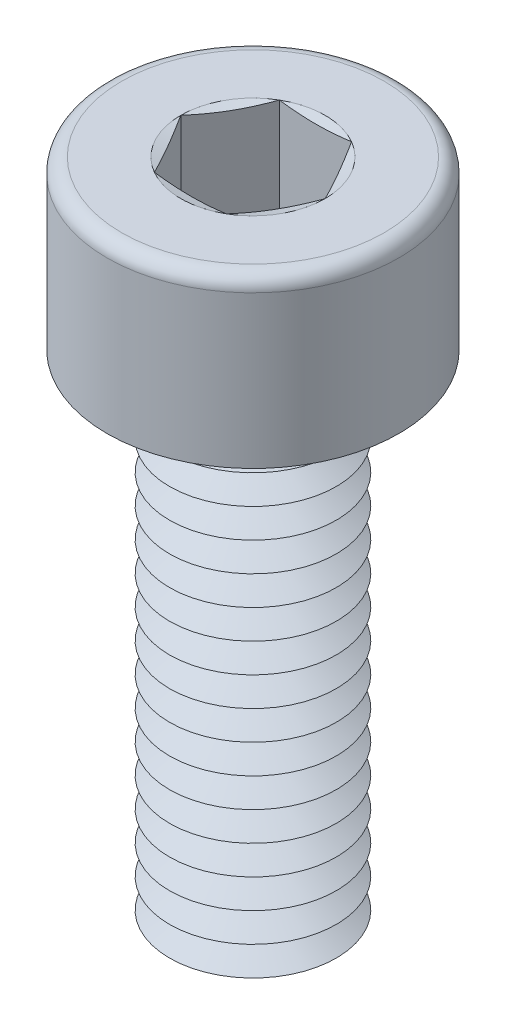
ISO-10303-21;
HEADER;
FILE_DESCRIPTION(('STEP AP214'),'2;1');
FILE_NAME('part.step','',(''),(''),'','','');
FILE_SCHEMA(('AUTOMOTIVE_DESIGN { 1 0 10303 214 1 1 1 1 }'));
ENDSEC;
DATA;
#1=APPLICATION_CONTEXT('core data for automotive mechanical design processes');
#2=APPLICATION_PROTOCOL_DEFINITION('international standard','automotive_design',2000,#1);
#3=PRODUCT_CONTEXT('',#1,'mechanical');
#4=PRODUCT('Part','Part','',(#3));
#5=PRODUCT_RELATED_PRODUCT_CATEGORY('part','',(#4));
#6=PRODUCT_DEFINITION_FORMATION('','',#4);
#7=PRODUCT_DEFINITION_CONTEXT('part definition',#1,'design');
#8=PRODUCT_DEFINITION('design','',#6,#7);
#9=PRODUCT_DEFINITION_SHAPE('','',#8);
#10=(LENGTH_UNIT() NAMED_UNIT(*) SI_UNIT(.MILLI.,.METRE.));
#11=(NAMED_UNIT(*) PLANE_ANGLE_UNIT() SI_UNIT($,.RADIAN.));
#12=(NAMED_UNIT(*) SI_UNIT($,.STERADIAN.) SOLID_ANGLE_UNIT());
#13=UNCERTAINTY_MEASURE_WITH_UNIT(LENGTH_MEASURE(1.E-05),#10,'distance_accuracy_value','');
#14=(GEOMETRIC_REPRESENTATION_CONTEXT(3) GLOBAL_UNCERTAINTY_ASSIGNED_CONTEXT((#13)) GLOBAL_UNIT_ASSIGNED_CONTEXT((#10,
#11,#12)) REPRESENTATION_CONTEXT('',''));
#15=CARTESIAN_POINT('',(0.,0.,0.));
#16=DIRECTION('',(0.,0.,1.));
#17=DIRECTION('',(1.,0.,0.));
#18=AXIS2_PLACEMENT_3D('',#15,#16,#17);
#19=CARTESIAN_POINT('',(0.,2.8,0.));
#20=DIRECTION('',(0.,1.,0.));
#21=DIRECTION('',(0.,0.,1.));
#22=AXIS2_PLACEMENT_3D('',#19,#20,#21);
#23=CONICAL_SURFACE('',#22,1.39378221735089,1.0471975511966);
#24=CARTESIAN_POINT('',(0.,3.15,0.));
#25=DIRECTION('',(0.,1.,0.));
#26=DIRECTION('',(0.,0.,1.));
#27=AXIS2_PLACEMENT_3D('',#24,#25,#26);
#28=CIRCLE('',#27,2.);
#29=CARTESIAN_POINT('',(0.,3.15,2.));
#30=VERTEX_POINT('',#29);
#31=EDGE_CURVE('E447',#30,#30,#28,.T.);
#32=ORIENTED_EDGE('',*,*,#31,.F.);
#33=EDGE_LOOP('',(#32));
#34=FACE_BOUND('',#33,.T.);
#35=CARTESIAN_POINT('',(0.,2.8,0.));
#36=DIRECTION('',(0.,1.,0.));
#37=DIRECTION('',(0.,0.,1.));
#38=AXIS2_PLACEMENT_3D('',#35,#36,#37);
#39=CIRCLE('',#38,1.39378221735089);
#40=CARTESIAN_POINT('',(0.,2.8,1.39378221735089));
#41=VERTEX_POINT('',#40);
#42=EDGE_CURVE('E451',#41,#41,#39,.T.);
#43=ORIENTED_EDGE('',*,*,#42,.T.);
#44=EDGE_LOOP('',(#43));
#45=FACE_BOUND('',#44,.T.);
#46=ADVANCED_FACE('F41',(#34,#45),#23,.T.);
#47=CARTESIAN_POINT('',(0.,2.45,0.));
#48=DIRECTION('',(0.,-1.,0.));
#49=DIRECTION('',(0.,0.,-1.));
#50=AXIS2_PLACEMENT_3D('',#47,#48,#49);
#51=CONICAL_SURFACE('',#50,2.,1.0471975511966);
#52=ORIENTED_EDGE('',*,*,#42,.F.);
#53=EDGE_LOOP('',(#52));
#54=FACE_BOUND('',#53,.T.);
#55=CARTESIAN_POINT('',(0.,2.45,0.));
#56=DIRECTION('',(0.,1.,0.));
#57=DIRECTION('',(0.,0.,1.));
#58=AXIS2_PLACEMENT_3D('',#55,#56,#57);
#59=CIRCLE('',#58,2.);
#60=CARTESIAN_POINT('',(0.,2.45,2.));
#61=VERTEX_POINT('',#60);
#62=EDGE_CURVE('E455',#61,#61,#59,.T.);
#63=ORIENTED_EDGE('',*,*,#62,.T.);
#64=EDGE_LOOP('',(#63));
#65=FACE_BOUND('',#64,.T.);
#66=ADVANCED_FACE('F251',(#54,#65),#51,.T.);
#67=CARTESIAN_POINT('',(0.,0.,0.));
#68=DIRECTION('',(0.,1.,0.));
#69=DIRECTION('',(0.,0.,1.));
#70=AXIS2_PLACEMENT_3D('',#67,#68,#69);
#71=PLANE('',#70);
#72=CARTESIAN_POINT('',(0.,0.,0.));
#73=DIRECTION('',(0.,1.,0.));
#74=DIRECTION('',(0.,0.,1.));
#75=AXIS2_PLACEMENT_3D('',#72,#73,#74);
#76=CIRCLE('',#75,1.39378221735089);
#77=CARTESIAN_POINT('',(0.,0.,1.39378221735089));
#78=VERTEX_POINT('',#77);
#79=EDGE_CURVE('E483',#78,#78,#76,.T.);
#80=ORIENTED_EDGE('',*,*,#79,.F.);
#81=EDGE_LOOP('',(#80));
#82=FACE_BOUND('',#81,.T.);
#83=ADVANCED_FACE('F248',(#82),#71,.F.);
#84=CARTESIAN_POINT('',(0.,0.,0.));
#85=DIRECTION('',(0.,1.,0.));
#86=DIRECTION('',(0.,0.,1.));
#87=AXIS2_PLACEMENT_3D('',#84,#85,#86);
#88=CONICAL_SURFACE('',#87,1.39378221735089,1.0471975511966);
#89=CARTESIAN_POINT('',(0.,0.35,0.));
#90=DIRECTION('',(0.,1.,0.));
#91=DIRECTION('',(0.,0.,1.));
#92=AXIS2_PLACEMENT_3D('',#89,#90,#91);
#93=CIRCLE('',#92,2.);
#94=CARTESIAN_POINT('',(0.,0.35,2.));
#95=VERTEX_POINT('',#94);
#96=EDGE_CURVE('E479',#95,#95,#93,.T.);
#97=ORIENTED_EDGE('',*,*,#96,.F.);
#98=EDGE_LOOP('',(#97));
#99=FACE_BOUND('',#98,.T.);
#100=ORIENTED_EDGE('',*,*,#79,.T.);
#101=EDGE_LOOP('',(#100));
#102=FACE_BOUND('',#101,.T.);
#103=ADVANCED_FACE('F250',(#99,#102),#88,.T.);
#104=CARTESIAN_POINT('',(0.,0.35,0.));
#105=DIRECTION('',(0.,-1.,0.));
#106=DIRECTION('',(0.,0.,-1.));
#107=AXIS2_PLACEMENT_3D('',#104,#105,#106);
#108=CONICAL_SURFACE('',#107,2.,1.0471975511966);
#109=CARTESIAN_POINT('',(0.,0.7,0.));
#110=DIRECTION('',(0.,1.,0.));
#111=DIRECTION('',(0.,0.,1.));
#112=AXIS2_PLACEMENT_3D('',#109,#110,#111);
#113=CIRCLE('',#112,1.39378221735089);
#114=CARTESIAN_POINT('',(0.,0.7,1.39378221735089));
#115=VERTEX_POINT('',#114);
#116=EDGE_CURVE('E475',#115,#115,#113,.T.);
#117=ORIENTED_EDGE('',*,*,#116,.F.);
#118=EDGE_LOOP('',(#117));
#119=FACE_BOUND('',#118,.T.);
#120=ORIENTED_EDGE('',*,*,#96,.T.);
#121=EDGE_LOOP('',(#120));
#122=FACE_BOUND('',#121,.T.);
#123=ADVANCED_FACE('F291',(#119,#122),#108,.T.);
#124=CARTESIAN_POINT('',(0.,0.7,0.));
#125=DIRECTION('',(0.,1.,0.));
#126=DIRECTION('',(0.,0.,1.));
#127=AXIS2_PLACEMENT_3D('',#124,#125,#126);
#128=CONICAL_SURFACE('',#127,1.39378221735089,1.0471975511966);
#129=CARTESIAN_POINT('',(0.,1.05,0.));
#130=DIRECTION('',(0.,1.,0.));
#131=DIRECTION('',(0.,0.,1.));
#132=AXIS2_PLACEMENT_3D('',#129,#130,#131);
#133=CIRCLE('',#132,2.);
#134=CARTESIAN_POINT('',(0.,1.05,2.));
#135=VERTEX_POINT('',#134);
#136=EDGE_CURVE('E471',#135,#135,#133,.T.);
#137=ORIENTED_EDGE('',*,*,#136,.F.);
#138=EDGE_LOOP('',(#137));
#139=FACE_BOUND('',#138,.T.);
#140=ORIENTED_EDGE('',*,*,#116,.T.);
#141=EDGE_LOOP('',(#140));
#142=FACE_BOUND('',#141,.T.);
#143=ADVANCED_FACE('F286',(#139,#142),#128,.T.);
#144=CARTESIAN_POINT('',(0.,1.05,0.));
#145=DIRECTION('',(0.,-1.,0.));
#146=DIRECTION('',(0.,0.,-1.));
#147=AXIS2_PLACEMENT_3D('',#144,#145,#146);
#148=CONICAL_SURFACE('',#147,2.,1.0471975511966);
#149=CARTESIAN_POINT('',(0.,1.4,0.));
#150=DIRECTION('',(0.,1.,0.));
#151=DIRECTION('',(0.,0.,1.));
#152=AXIS2_PLACEMENT_3D('',#149,#150,#151);
#153=CIRCLE('',#152,1.39378221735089);
#154=CARTESIAN_POINT('',(0.,1.4,1.39378221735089));
#155=VERTEX_POINT('',#154);
#156=EDGE_CURVE('E467',#155,#155,#153,.T.);
#157=ORIENTED_EDGE('',*,*,#156,.F.);
#158=EDGE_LOOP('',(#157));
#159=FACE_BOUND('',#158,.T.);
#160=ORIENTED_EDGE('',*,*,#136,.T.);
#161=EDGE_LOOP('',(#160));
#162=FACE_BOUND('',#161,.T.);
#163=ADVANCED_FACE('F283',(#159,#162),#148,.T.);
#164=CARTESIAN_POINT('',(0.,1.4,0.));
#165=DIRECTION('',(0.,1.,0.));
#166=DIRECTION('',(0.,0.,1.));
#167=AXIS2_PLACEMENT_3D('',#164,#165,#166);
#168=CONICAL_SURFACE('',#167,1.39378221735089,1.0471975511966);
#169=CARTESIAN_POINT('',(0.,1.75,0.));
#170=DIRECTION('',(0.,1.,0.));
#171=DIRECTION('',(0.,0.,1.));
#172=AXIS2_PLACEMENT_3D('',#169,#170,#171);
#173=CIRCLE('',#172,2.);
#174=CARTESIAN_POINT('',(0.,1.75,2.));
#175=VERTEX_POINT('',#174);
#176=EDGE_CURVE('E463',#175,#175,#173,.T.);
#177=ORIENTED_EDGE('',*,*,#176,.F.);
#178=EDGE_LOOP('',(#177));
#179=FACE_BOUND('',#178,.T.);
#180=ORIENTED_EDGE('',*,*,#156,.T.);
#181=EDGE_LOOP('',(#180));
#182=FACE_BOUND('',#181,.T.);
#183=ADVANCED_FACE('F277',(#179,#182),#168,.T.);
#184=CARTESIAN_POINT('',(0.,1.75,0.));
#185=DIRECTION('',(0.,-1.,0.));
#186=DIRECTION('',(0.,0.,-1.));
#187=AXIS2_PLACEMENT_3D('',#184,#185,#186);
#188=CONICAL_SURFACE('',#187,2.,1.0471975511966);
#189=CARTESIAN_POINT('',(0.,2.1,0.));
#190=DIRECTION('',(0.,1.,0.));
#191=DIRECTION('',(0.,0.,1.));
#192=AXIS2_PLACEMENT_3D('',#189,#190,#191);
#193=CIRCLE('',#192,1.39378221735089);
#194=CARTESIAN_POINT('',(0.,2.1,1.39378221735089));
#195=VERTEX_POINT('',#194);
#196=EDGE_CURVE('E459',#195,#195,#193,.T.);
#197=ORIENTED_EDGE('',*,*,#196,.F.);
#198=EDGE_LOOP('',(#197));
#199=FACE_BOUND('',#198,.T.);
#200=ORIENTED_EDGE('',*,*,#176,.T.);
#201=EDGE_LOOP('',(#200));
#202=FACE_BOUND('',#201,.T.);
#203=ADVANCED_FACE('F273',(#199,#202),#188,.T.);
#204=CARTESIAN_POINT('',(0.,2.1,0.));
#205=DIRECTION('',(0.,1.,0.));
#206=DIRECTION('',(0.,0.,1.));
#207=AXIS2_PLACEMENT_3D('',#204,#205,#206);
#208=CONICAL_SURFACE('',#207,1.39378221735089,1.0471975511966);
#209=ORIENTED_EDGE('',*,*,#62,.F.);
#210=EDGE_LOOP('',(#209));
#211=FACE_BOUND('',#210,.T.);
#212=ORIENTED_EDGE('',*,*,#196,.T.);
#213=EDGE_LOOP('',(#212));
#214=FACE_BOUND('',#213,.T.);
#215=ADVANCED_FACE('F276',(#211,#214),#208,.T.);
#216=CARTESIAN_POINT('',(0.,3.5,0.));
#217=DIRECTION('',(0.,1.,0.));
#218=DIRECTION('',(0.,0.,1.));
#219=AXIS2_PLACEMENT_3D('',#216,#217,#218);
#220=CONICAL_SURFACE('',#219,1.39378221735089,1.0471975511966);
#221=CARTESIAN_POINT('',(0.,3.85,0.));
#222=DIRECTION('',(0.,1.,0.));
#223=DIRECTION('',(0.,0.,1.));
#224=AXIS2_PLACEMENT_3D('',#221,#222,#223);
#225=CIRCLE('',#224,2.);
#226=CARTESIAN_POINT('',(0.,3.85,2.));
#227=VERTEX_POINT('',#226);
#228=EDGE_CURVE('E439',#227,#227,#225,.T.);
#229=ORIENTED_EDGE('',*,*,#228,.F.);
#230=EDGE_LOOP('',(#229));
#231=FACE_BOUND('',#230,.T.);
#232=CARTESIAN_POINT('',(0.,3.5,0.));
#233=DIRECTION('',(0.,1.,0.));
#234=DIRECTION('',(0.,0.,1.));
#235=AXIS2_PLACEMENT_3D('',#232,#233,#234);
#236=CIRCLE('',#235,1.39378221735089);
#237=CARTESIAN_POINT('',(0.,3.5,1.39378221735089));
#238=VERTEX_POINT('',#237);
#239=EDGE_CURVE('E443',#238,#238,#236,.T.);
#240=ORIENTED_EDGE('',*,*,#239,.T.);
#241=EDGE_LOOP('',(#240));
#242=FACE_BOUND('',#241,.T.);
#243=ADVANCED_FACE('F281',(#231,#242),#220,.T.);
#244=CARTESIAN_POINT('',(0.,3.15,0.));
#245=DIRECTION('',(0.,-1.,0.));
#246=DIRECTION('',(0.,0.,-1.));
#247=AXIS2_PLACEMENT_3D('',#244,#245,#246);
#248=CONICAL_SURFACE('',#247,2.,1.0471975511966);
#249=ORIENTED_EDGE('',*,*,#239,.F.);
#250=EDGE_LOOP('',(#249));
#251=FACE_BOUND('',#250,.T.);
#252=ORIENTED_EDGE('',*,*,#31,.T.);
#253=EDGE_LOOP('',(#252));
#254=FACE_BOUND('',#253,.T.);
#255=ADVANCED_FACE('F724',(#251,#254),#248,.T.);
#256=CARTESIAN_POINT('',(0.,4.2,0.));
#257=DIRECTION('',(0.,1.,0.));
#258=DIRECTION('',(0.,0.,1.));
#259=AXIS2_PLACEMENT_3D('',#256,#257,#258);
#260=CONICAL_SURFACE('',#259,1.39378221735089,1.0471975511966);
#261=CARTESIAN_POINT('',(0.,4.55,0.));
#262=DIRECTION('',(0.,1.,0.));
#263=DIRECTION('',(0.,0.,1.));
#264=AXIS2_PLACEMENT_3D('',#261,#262,#263);
#265=CIRCLE('',#264,2.);
#266=CARTESIAN_POINT('',(0.,4.55,2.));
#267=VERTEX_POINT('',#266);
#268=EDGE_CURVE('E431',#267,#267,#265,.T.);
#269=ORIENTED_EDGE('',*,*,#268,.F.);
#270=EDGE_LOOP('',(#269));
#271=FACE_BOUND('',#270,.T.);
#272=CARTESIAN_POINT('',(0.,4.2,0.));
#273=DIRECTION('',(0.,1.,0.));
#274=DIRECTION('',(0.,0.,1.));
#275=AXIS2_PLACEMENT_3D('',#272,#273,#274);
#276=CIRCLE('',#275,1.39378221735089);
#277=CARTESIAN_POINT('',(0.,4.2,1.39378221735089));
#278=VERTEX_POINT('',#277);
#279=EDGE_CURVE('E435',#278,#278,#276,.T.);
#280=ORIENTED_EDGE('',*,*,#279,.T.);
#281=EDGE_LOOP('',(#280));
#282=FACE_BOUND('',#281,.T.);
#283=ADVANCED_FACE('F733',(#271,#282),#260,.T.);
#284=CARTESIAN_POINT('',(0.,3.85,0.));
#285=DIRECTION('',(0.,-1.,0.));
#286=DIRECTION('',(0.,0.,-1.));
#287=AXIS2_PLACEMENT_3D('',#284,#285,#286);
#288=CONICAL_SURFACE('',#287,2.,1.0471975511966);
#289=ORIENTED_EDGE('',*,*,#279,.F.);
#290=EDGE_LOOP('',(#289));
#291=FACE_BOUND('',#290,.T.);
#292=ORIENTED_EDGE('',*,*,#228,.T.);
#293=EDGE_LOOP('',(#292));
#294=FACE_BOUND('',#293,.T.);
#295=ADVANCED_FACE('F743',(#291,#294),#288,.T.);
#296=CARTESIAN_POINT('',(0.,4.9,0.));
#297=DIRECTION('',(0.,1.,0.));
#298=DIRECTION('',(0.,0.,1.));
#299=AXIS2_PLACEMENT_3D('',#296,#297,#298);
#300=CONICAL_SURFACE('',#299,1.39378221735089,1.0471975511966);
#301=CARTESIAN_POINT('',(0.,5.25,0.));
#302=DIRECTION('',(0.,1.,0.));
#303=DIRECTION('',(0.,0.,1.));
#304=AXIS2_PLACEMENT_3D('',#301,#302,#303);
#305=CIRCLE('',#304,2.);
#306=CARTESIAN_POINT('',(0.,5.25,2.));
#307=VERTEX_POINT('',#306);
#308=EDGE_CURVE('E423',#307,#307,#305,.T.);
#309=ORIENTED_EDGE('',*,*,#308,.F.);
#310=EDGE_LOOP('',(#309));
#311=FACE_BOUND('',#310,.T.);
#312=CARTESIAN_POINT('',(0.,4.9,0.));
#313=DIRECTION('',(0.,1.,0.));
#314=DIRECTION('',(0.,0.,1.));
#315=AXIS2_PLACEMENT_3D('',#312,#313,#314);
#316=CIRCLE('',#315,1.39378221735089);
#317=CARTESIAN_POINT('',(0.,4.9,1.39378221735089));
#318=VERTEX_POINT('',#317);
#319=EDGE_CURVE('E427',#318,#318,#316,.T.);
#320=ORIENTED_EDGE('',*,*,#319,.T.);
#321=EDGE_LOOP('',(#320));
#322=FACE_BOUND('',#321,.T.);
#323=ADVANCED_FACE('F753',(#311,#322),#300,.T.);
#324=CARTESIAN_POINT('',(0.,4.55,0.));
#325=DIRECTION('',(0.,-1.,0.));
#326=DIRECTION('',(0.,0.,-1.));
#327=AXIS2_PLACEMENT_3D('',#324,#325,#326);
#328=CONICAL_SURFACE('',#327,2.,1.0471975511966);
#329=ORIENTED_EDGE('',*,*,#319,.F.);
#330=EDGE_LOOP('',(#329));
#331=FACE_BOUND('',#330,.T.);
#332=ORIENTED_EDGE('',*,*,#268,.T.);
#333=EDGE_LOOP('',(#332));
#334=FACE_BOUND('',#333,.T.);
#335=ADVANCED_FACE('F763',(#331,#334),#328,.T.);
#336=CARTESIAN_POINT('',(0.,5.6,0.));
#337=DIRECTION('',(0.,1.,0.));
#338=DIRECTION('',(0.,0.,1.));
#339=AXIS2_PLACEMENT_3D('',#336,#337,#338);
#340=CONICAL_SURFACE('',#339,1.39378221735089,1.0471975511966);
#341=CARTESIAN_POINT('',(0.,5.95,0.));
#342=DIRECTION('',(0.,1.,0.));
#343=DIRECTION('',(0.,0.,1.));
#344=AXIS2_PLACEMENT_3D('',#341,#342,#343);
#345=CIRCLE('',#344,2.);
#346=CARTESIAN_POINT('',(0.,5.95,2.));
#347=VERTEX_POINT('',#346);
#348=EDGE_CURVE('E415',#347,#347,#345,.T.);
#349=ORIENTED_EDGE('',*,*,#348,.F.);
#350=EDGE_LOOP('',(#349));
#351=FACE_BOUND('',#350,.T.);
#352=CARTESIAN_POINT('',(0.,5.6,0.));
#353=DIRECTION('',(0.,1.,0.));
#354=DIRECTION('',(0.,0.,1.));
#355=AXIS2_PLACEMENT_3D('',#352,#353,#354);
#356=CIRCLE('',#355,1.39378221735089);
#357=CARTESIAN_POINT('',(0.,5.6,1.39378221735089));
#358=VERTEX_POINT('',#357);
#359=EDGE_CURVE('E419',#358,#358,#356,.T.);
#360=ORIENTED_EDGE('',*,*,#359,.T.);
#361=EDGE_LOOP('',(#360));
#362=FACE_BOUND('',#361,.T.);
#363=ADVANCED_FACE('F773',(#351,#362),#340,.T.);
#364=CARTESIAN_POINT('',(0.,5.25,0.));
#365=DIRECTION('',(0.,-1.,0.));
#366=DIRECTION('',(0.,0.,-1.));
#367=AXIS2_PLACEMENT_3D('',#364,#365,#366);
#368=CONICAL_SURFACE('',#367,2.,1.0471975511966);
#369=ORIENTED_EDGE('',*,*,#359,.F.);
#370=EDGE_LOOP('',(#369));
#371=FACE_BOUND('',#370,.T.);
#372=ORIENTED_EDGE('',*,*,#308,.T.);
#373=EDGE_LOOP('',(#372));
#374=FACE_BOUND('',#373,.T.);
#375=ADVANCED_FACE('F783',(#371,#374),#368,.T.);
#376=CARTESIAN_POINT('',(0.,6.3,0.));
#377=DIRECTION('',(0.,1.,0.));
#378=DIRECTION('',(0.,0.,1.));
#379=AXIS2_PLACEMENT_3D('',#376,#377,#378);
#380=CONICAL_SURFACE('',#379,1.39378221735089,1.0471975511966);
#381=CARTESIAN_POINT('',(0.,6.65,0.));
#382=DIRECTION('',(0.,1.,0.));
#383=DIRECTION('',(0.,0.,1.));
#384=AXIS2_PLACEMENT_3D('',#381,#382,#383);
#385=CIRCLE('',#384,2.);
#386=CARTESIAN_POINT('',(0.,6.65,2.));
#387=VERTEX_POINT('',#386);
#388=EDGE_CURVE('E407',#387,#387,#385,.T.);
#389=ORIENTED_EDGE('',*,*,#388,.F.);
#390=EDGE_LOOP('',(#389));
#391=FACE_BOUND('',#390,.T.);
#392=CARTESIAN_POINT('',(0.,6.3,0.));
#393=DIRECTION('',(0.,1.,0.));
#394=DIRECTION('',(0.,0.,1.));
#395=AXIS2_PLACEMENT_3D('',#392,#393,#394);
#396=CIRCLE('',#395,1.39378221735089);
#397=CARTESIAN_POINT('',(0.,6.3,1.39378221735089));
#398=VERTEX_POINT('',#397);
#399=EDGE_CURVE('E411',#398,#398,#396,.T.);
#400=ORIENTED_EDGE('',*,*,#399,.T.);
#401=EDGE_LOOP('',(#400));
#402=FACE_BOUND('',#401,.T.);
#403=ADVANCED_FACE('F793',(#391,#402),#380,.T.);
#404=CARTESIAN_POINT('',(0.,5.95,0.));
#405=DIRECTION('',(0.,-1.,0.));
#406=DIRECTION('',(0.,0.,-1.));
#407=AXIS2_PLACEMENT_3D('',#404,#405,#406);
#408=CONICAL_SURFACE('',#407,2.,1.0471975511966);
#409=ORIENTED_EDGE('',*,*,#399,.F.);
#410=EDGE_LOOP('',(#409));
#411=FACE_BOUND('',#410,.T.);
#412=ORIENTED_EDGE('',*,*,#348,.T.);
#413=EDGE_LOOP('',(#412));
#414=FACE_BOUND('',#413,.T.);
#415=ADVANCED_FACE('F803',(#411,#414),#408,.T.);
#416=CARTESIAN_POINT('',(0.,7.,0.));
#417=DIRECTION('',(0.,1.,0.));
#418=DIRECTION('',(0.,0.,1.));
#419=AXIS2_PLACEMENT_3D('',#416,#417,#418);
#420=CONICAL_SURFACE('',#419,1.39378221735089,1.0471975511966);
#421=CARTESIAN_POINT('',(0.,7.35,0.));
#422=DIRECTION('',(0.,1.,0.));
#423=DIRECTION('',(0.,0.,1.));
#424=AXIS2_PLACEMENT_3D('',#421,#422,#423);
#425=CIRCLE('',#424,2.);
#426=CARTESIAN_POINT('',(0.,7.35,2.));
#427=VERTEX_POINT('',#426);
#428=EDGE_CURVE('E399',#427,#427,#425,.T.);
#429=ORIENTED_EDGE('',*,*,#428,.F.);
#430=EDGE_LOOP('',(#429));
#431=FACE_BOUND('',#430,.T.);
#432=CARTESIAN_POINT('',(0.,7.,0.));
#433=DIRECTION('',(0.,1.,0.));
#434=DIRECTION('',(0.,0.,1.));
#435=AXIS2_PLACEMENT_3D('',#432,#433,#434);
#436=CIRCLE('',#435,1.39378221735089);
#437=CARTESIAN_POINT('',(0.,7.,1.39378221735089));
#438=VERTEX_POINT('',#437);
#439=EDGE_CURVE('E403',#438,#438,#436,.T.);
#440=ORIENTED_EDGE('',*,*,#439,.T.);
#441=EDGE_LOOP('',(#440));
#442=FACE_BOUND('',#441,.T.);
#443=ADVANCED_FACE('F813',(#431,#442),#420,.T.);
#444=CARTESIAN_POINT('',(0.,6.65,0.));
#445=DIRECTION('',(0.,-1.,0.));
#446=DIRECTION('',(0.,0.,-1.));
#447=AXIS2_PLACEMENT_3D('',#444,#445,#446);
#448=CONICAL_SURFACE('',#447,2.,1.0471975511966);
#449=ORIENTED_EDGE('',*,*,#439,.F.);
#450=EDGE_LOOP('',(#449));
#451=FACE_BOUND('',#450,.T.);
#452=ORIENTED_EDGE('',*,*,#388,.T.);
#453=EDGE_LOOP('',(#452));
#454=FACE_BOUND('',#453,.T.);
#455=ADVANCED_FACE('F823',(#451,#454),#448,.T.);
#456=CARTESIAN_POINT('',(0.,7.7,0.));
#457=DIRECTION('',(0.,1.,0.));
#458=DIRECTION('',(0.,0.,1.));
#459=AXIS2_PLACEMENT_3D('',#456,#457,#458);
#460=CONICAL_SURFACE('',#459,1.39378221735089,1.0471975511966);
#461=CARTESIAN_POINT('',(0.,8.05,0.));
#462=DIRECTION('',(0.,1.,0.));
#463=DIRECTION('',(0.,0.,1.));
#464=AXIS2_PLACEMENT_3D('',#461,#462,#463);
#465=CIRCLE('',#464,2.);
#466=CARTESIAN_POINT('',(0.,8.05,2.));
#467=VERTEX_POINT('',#466);
#468=EDGE_CURVE('E391',#467,#467,#465,.T.);
#469=ORIENTED_EDGE('',*,*,#468,.F.);
#470=EDGE_LOOP('',(#469));
#471=FACE_BOUND('',#470,.T.);
#472=CARTESIAN_POINT('',(0.,7.7,0.));
#473=DIRECTION('',(0.,1.,0.));
#474=DIRECTION('',(0.,0.,1.));
#475=AXIS2_PLACEMENT_3D('',#472,#473,#474);
#476=CIRCLE('',#475,1.39378221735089);
#477=CARTESIAN_POINT('',(0.,7.7,1.39378221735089));
#478=VERTEX_POINT('',#477);
#479=EDGE_CURVE('E395',#478,#478,#476,.T.);
#480=ORIENTED_EDGE('',*,*,#479,.T.);
#481=EDGE_LOOP('',(#480));
#482=FACE_BOUND('',#481,.T.);
#483=ADVANCED_FACE('F833',(#471,#482),#460,.T.);
#484=CARTESIAN_POINT('',(0.,7.35,0.));
#485=DIRECTION('',(0.,-1.,0.));
#486=DIRECTION('',(0.,0.,-1.));
#487=AXIS2_PLACEMENT_3D('',#484,#485,#486);
#488=CONICAL_SURFACE('',#487,2.,1.0471975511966);
#489=ORIENTED_EDGE('',*,*,#479,.F.);
#490=EDGE_LOOP('',(#489));
#491=FACE_BOUND('',#490,.T.);
#492=ORIENTED_EDGE('',*,*,#428,.T.);
#493=EDGE_LOOP('',(#492));
#494=FACE_BOUND('',#493,.T.);
#495=ADVANCED_FACE('F843',(#491,#494),#488,.T.);
#496=CARTESIAN_POINT('',(0.,8.4,0.));
#497=DIRECTION('',(0.,1.,0.));
#498=DIRECTION('',(0.,0.,1.));
#499=AXIS2_PLACEMENT_3D('',#496,#497,#498);
#500=CONICAL_SURFACE('',#499,1.39378221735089,1.0471975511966);
#501=CARTESIAN_POINT('',(0.,8.75,0.));
#502=DIRECTION('',(0.,1.,0.));
#503=DIRECTION('',(0.,0.,1.));
#504=AXIS2_PLACEMENT_3D('',#501,#502,#503);
#505=CIRCLE('',#504,2.);
#506=CARTESIAN_POINT('',(0.,8.75,2.));
#507=VERTEX_POINT('',#506);
#508=EDGE_CURVE('E384',#507,#507,#505,.T.);
#509=ORIENTED_EDGE('',*,*,#508,.F.);
#510=EDGE_LOOP('',(#509));
#511=FACE_BOUND('',#510,.T.);
#512=CARTESIAN_POINT('',(0.,8.4,0.));
#513=DIRECTION('',(0.,1.,0.));
#514=DIRECTION('',(0.,0.,1.));
#515=AXIS2_PLACEMENT_3D('',#512,#513,#514);
#516=CIRCLE('',#515,1.39378221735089);
#517=CARTESIAN_POINT('',(0.,8.4,1.39378221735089));
#518=VERTEX_POINT('',#517);
#519=EDGE_CURVE('E388',#518,#518,#516,.T.);
#520=ORIENTED_EDGE('',*,*,#519,.T.);
#521=EDGE_LOOP('',(#520));
#522=FACE_BOUND('',#521,.T.);
#523=ADVANCED_FACE('F853',(#511,#522),#500,.T.);
#524=CARTESIAN_POINT('',(0.,8.05,0.));
#525=DIRECTION('',(0.,-1.,0.));
#526=DIRECTION('',(0.,0.,-1.));
#527=AXIS2_PLACEMENT_3D('',#524,#525,#526);
#528=CONICAL_SURFACE('',#527,2.,1.0471975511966);
#529=ORIENTED_EDGE('',*,*,#519,.F.);
#530=EDGE_LOOP('',(#529));
#531=FACE_BOUND('',#530,.T.);
#532=ORIENTED_EDGE('',*,*,#468,.T.);
#533=EDGE_LOOP('',(#532));
#534=FACE_BOUND('',#533,.T.);
#535=ADVANCED_FACE('F863',(#531,#534),#528,.T.);
#536=CARTESIAN_POINT('',(0.,9.1,0.));
#537=DIRECTION('',(0.,1.,0.));
#538=DIRECTION('',(0.,0.,1.));
#539=AXIS2_PLACEMENT_3D('',#536,#537,#538);
#540=CONICAL_SURFACE('',#539,1.39378221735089,1.0471975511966);
#541=CARTESIAN_POINT('',(0.,9.45,0.));
#542=DIRECTION('',(0.,1.,0.));
#543=DIRECTION('',(0.,0.,1.));
#544=AXIS2_PLACEMENT_3D('',#541,#542,#543);
#545=CIRCLE('',#544,2.);
#546=CARTESIAN_POINT('',(0.,9.45,2.));
#547=VERTEX_POINT('',#546);
#548=EDGE_CURVE('E376',#547,#547,#545,.T.);
#549=ORIENTED_EDGE('',*,*,#548,.F.);
#550=EDGE_LOOP('',(#549));
#551=FACE_BOUND('',#550,.T.);
#552=CARTESIAN_POINT('',(0.,9.1,0.));
#553=DIRECTION('',(0.,1.,0.));
#554=DIRECTION('',(0.,0.,1.));
#555=AXIS2_PLACEMENT_3D('',#552,#553,#554);
#556=CIRCLE('',#555,1.39378221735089);
#557=CARTESIAN_POINT('',(0.,9.1,1.39378221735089));
#558=VERTEX_POINT('',#557);
#559=EDGE_CURVE('E380',#558,#558,#556,.T.);
#560=ORIENTED_EDGE('',*,*,#559,.T.);
#561=EDGE_LOOP('',(#560));
#562=FACE_BOUND('',#561,.T.);
#563=ADVANCED_FACE('F873',(#551,#562),#540,.T.);
#564=CARTESIAN_POINT('',(0.,8.75,0.));
#565=DIRECTION('',(0.,-1.,0.));
#566=DIRECTION('',(0.,0.,-1.));
#567=AXIS2_PLACEMENT_3D('',#564,#565,#566);
#568=CONICAL_SURFACE('',#567,2.,1.0471975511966);
#569=ORIENTED_EDGE('',*,*,#559,.F.);
#570=EDGE_LOOP('',(#569));
#571=FACE_BOUND('',#570,.T.);
#572=ORIENTED_EDGE('',*,*,#508,.T.);
#573=EDGE_LOOP('',(#572));
#574=FACE_BOUND('',#573,.T.);
#575=ADVANCED_FACE('F883',(#571,#574),#568,.T.);
#576=CARTESIAN_POINT('',(0.,9.8,0.));
#577=DIRECTION('',(0.,1.,0.));
#578=DIRECTION('',(0.,0.,1.));
#579=AXIS2_PLACEMENT_3D('',#576,#577,#578);
#580=CONICAL_SURFACE('',#579,1.39378221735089,1.0471975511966);
#581=CARTESIAN_POINT('',(0.,10.15,0.));
#582=DIRECTION('',(0.,1.,0.));
#583=DIRECTION('',(0.,0.,1.));
#584=AXIS2_PLACEMENT_3D('',#581,#582,#583);
#585=CIRCLE('',#584,2.);
#586=CARTESIAN_POINT('',(0.,10.15,2.));
#587=VERTEX_POINT('',#586);
#588=EDGE_CURVE('E368',#587,#587,#585,.T.);
#589=ORIENTED_EDGE('',*,*,#588,.F.);
#590=EDGE_LOOP('',(#589));
#591=FACE_BOUND('',#590,.T.);
#592=CARTESIAN_POINT('',(0.,9.8,0.));
#593=DIRECTION('',(0.,1.,0.));
#594=DIRECTION('',(0.,0.,1.));
#595=AXIS2_PLACEMENT_3D('',#592,#593,#594);
#596=CIRCLE('',#595,1.39378221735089);
#597=CARTESIAN_POINT('',(0.,9.8,1.39378221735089));
#598=VERTEX_POINT('',#597);
#599=EDGE_CURVE('E372',#598,#598,#596,.T.);
#600=ORIENTED_EDGE('',*,*,#599,.T.);
#601=EDGE_LOOP('',(#600));
#602=FACE_BOUND('',#601,.T.);
#603=ADVANCED_FACE('F893',(#591,#602),#580,.T.);
#604=CARTESIAN_POINT('',(0.,9.45,0.));
#605=DIRECTION('',(0.,-1.,0.));
#606=DIRECTION('',(0.,0.,-1.));
#607=AXIS2_PLACEMENT_3D('',#604,#605,#606);
#608=CONICAL_SURFACE('',#607,2.,1.0471975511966);
#609=ORIENTED_EDGE('',*,*,#599,.F.);
#610=EDGE_LOOP('',(#609));
#611=FACE_BOUND('',#610,.T.);
#612=ORIENTED_EDGE('',*,*,#548,.T.);
#613=EDGE_LOOP('',(#612));
#614=FACE_BOUND('',#613,.T.);
#615=ADVANCED_FACE('F903',(#611,#614),#608,.T.);
#616=CARTESIAN_POINT('',(0.,10.5,0.));
#617=DIRECTION('',(0.,1.,0.));
#618=DIRECTION('',(0.,0.,1.));
#619=AXIS2_PLACEMENT_3D('',#616,#617,#618);
#620=CONICAL_SURFACE('',#619,1.39378221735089,1.0471975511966);
#621=CARTESIAN_POINT('',(0.,10.85,0.));
#622=DIRECTION('',(0.,1.,0.));
#623=DIRECTION('',(0.,0.,1.));
#624=AXIS2_PLACEMENT_3D('',#621,#622,#623);
#625=CIRCLE('',#624,2.);
#626=CARTESIAN_POINT('',(0.,10.85,2.));
#627=VERTEX_POINT('',#626);
#628=EDGE_CURVE('E353',#627,#627,#625,.T.);
#629=ORIENTED_EDGE('',*,*,#628,.F.);
#630=EDGE_LOOP('',(#629));
#631=FACE_BOUND('',#630,.T.);
#632=CARTESIAN_POINT('',(0.,10.5,0.));
#633=DIRECTION('',(0.,1.,0.));
#634=DIRECTION('',(0.,0.,1.));
#635=AXIS2_PLACEMENT_3D('',#632,#633,#634);
#636=CIRCLE('',#635,1.39378221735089);
#637=CARTESIAN_POINT('',(0.,10.5,1.39378221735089));
#638=VERTEX_POINT('',#637);
#639=EDGE_CURVE('E365',#638,#638,#636,.T.);
#640=ORIENTED_EDGE('',*,*,#639,.T.);
#641=EDGE_LOOP('',(#640));
#642=FACE_BOUND('',#641,.T.);
#643=ADVANCED_FACE('F913',(#631,#642),#620,.T.);
#644=CARTESIAN_POINT('',(0.,10.15,0.));
#645=DIRECTION('',(0.,-1.,0.));
#646=DIRECTION('',(0.,0.,-1.));
#647=AXIS2_PLACEMENT_3D('',#644,#645,#646);
#648=CONICAL_SURFACE('',#647,2.,1.0471975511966);
#649=ORIENTED_EDGE('',*,*,#639,.F.);
#650=EDGE_LOOP('',(#649));
#651=FACE_BOUND('',#650,.T.);
#652=ORIENTED_EDGE('',*,*,#588,.T.);
#653=EDGE_LOOP('',(#652));
#654=FACE_BOUND('',#653,.T.);
#655=ADVANCED_FACE('F923',(#651,#654),#648,.T.);
#656=CARTESIAN_POINT('',(0.,11.2,0.));
#657=DIRECTION('',(0.,1.,0.));
#658=DIRECTION('',(0.,0.,1.));
#659=AXIS2_PLACEMENT_3D('',#656,#657,#658);
#660=CONICAL_SURFACE('',#659,1.39378221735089,1.0471975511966);
#661=CARTESIAN_POINT('',(0.,11.55,0.));
#662=DIRECTION('',(0.,1.,0.));
#663=DIRECTION('',(0.,0.,1.));
#664=AXIS2_PLACEMENT_3D('',#661,#662,#663);
#665=CIRCLE('',#664,2.);
#666=CARTESIAN_POINT('',(0.,11.55,2.));
#667=VERTEX_POINT('',#666);
#668=EDGE_CURVE('E360',#667,#667,#665,.T.);
#669=ORIENTED_EDGE('',*,*,#668,.F.);
#670=EDGE_LOOP('',(#669));
#671=FACE_BOUND('',#670,.T.);
#672=CARTESIAN_POINT('',(0.,11.2,0.));
#673=DIRECTION('',(0.,1.,0.));
#674=DIRECTION('',(0.,0.,1.));
#675=AXIS2_PLACEMENT_3D('',#672,#673,#674);
#676=CIRCLE('',#675,1.39378221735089);
#677=CARTESIAN_POINT('',(0.,11.2,1.39378221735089));
#678=VERTEX_POINT('',#677);
#679=EDGE_CURVE('E348',#678,#678,#676,.T.);
#680=ORIENTED_EDGE('',*,*,#679,.T.);
#681=EDGE_LOOP('',(#680));
#682=FACE_BOUND('',#681,.T.);
#683=ADVANCED_FACE('F933',(#671,#682),#660,.T.);
#684=CARTESIAN_POINT('',(0.,10.85,0.));
#685=DIRECTION('',(0.,-1.,0.));
#686=DIRECTION('',(0.,0.,-1.));
#687=AXIS2_PLACEMENT_3D('',#684,#685,#686);
#688=CONICAL_SURFACE('',#687,2.,1.0471975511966);
#689=ORIENTED_EDGE('',*,*,#679,.F.);
#690=EDGE_LOOP('',(#689));
#691=FACE_BOUND('',#690,.T.);
#692=ORIENTED_EDGE('',*,*,#628,.T.);
#693=EDGE_LOOP('',(#692));
#694=FACE_BOUND('',#693,.T.);
#695=ADVANCED_FACE('F195',(#691,#694),#688,.T.);
#696=CARTESIAN_POINT('',(0.,16.,0.));
#697=DIRECTION('',(0.,1.,0.));
#698=DIRECTION('',(0.,0.,1.));
#699=AXIS2_PLACEMENT_3D('',#696,#697,#698);
#700=PLANE('',#699);
#701=CARTESIAN_POINT('',(0.,16.,0.));
#702=DIRECTION('',(0.,1.,0.));
#703=DIRECTION('',(0.,0.,1.));
#704=AXIS2_PLACEMENT_3D('',#701,#702,#703);
#705=CIRCLE('',#704,1.73205080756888);
#706=CARTESIAN_POINT('',(0.866025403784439,16.,1.5));
#707=VERTEX_POINT('',#706);
#708=CARTESIAN_POINT('',(1.73205080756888,16.,0.));
#709=VERTEX_POINT('',#708);
#710=EDGE_CURVE('E121',#707,#709,#705,.T.);
#711=ORIENTED_EDGE('',*,*,#710,.F.);
#712=CARTESIAN_POINT('',(0.,16.,0.));
#713=DIRECTION('',(0.,1.,0.));
#714=DIRECTION('',(0.,0.,1.));
#715=AXIS2_PLACEMENT_3D('',#712,#713,#714);
#716=CIRCLE('',#715,1.73205080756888);
#717=CARTESIAN_POINT('',(-0.866025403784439,16.,1.5));
#718=VERTEX_POINT('',#717);
#719=EDGE_CURVE('E45',#718,#707,#716,.T.);
#720=ORIENTED_EDGE('',*,*,#719,.F.);
#721=CARTESIAN_POINT('',(-1.73205080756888,16.,0.));
#722=VERTEX_POINT('',#721);
#723=EDGE_CURVE('E138',#722,#718,#716,.T.);
#724=ORIENTED_EDGE('',*,*,#723,.F.);
#725=CARTESIAN_POINT('',(-0.866025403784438,16.,-1.5));
#726=VERTEX_POINT('',#725);
#727=EDGE_CURVE('E558',#726,#722,#716,.T.);
#728=ORIENTED_EDGE('',*,*,#727,.F.);
#729=CARTESIAN_POINT('',(0.866025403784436,16.,-1.5));
#730=VERTEX_POINT('',#729);
#731=EDGE_CURVE('E51',#730,#726,#716,.T.);
#732=ORIENTED_EDGE('',*,*,#731,.F.);
#733=EDGE_CURVE('E11',#709,#730,#716,.T.);
#734=ORIENTED_EDGE('',*,*,#733,.F.);
#735=EDGE_LOOP('',(#711,#720,#724,#728,#732,#734));
#736=FACE_BOUND('',#735,.T.);
#737=CARTESIAN_POINT('',(0.,16.,0.));
#738=DIRECTION('',(0.,1.,0.));
#739=DIRECTION('',(0.,0.,1.));
#740=AXIS2_PLACEMENT_3D('',#737,#738,#739);
#741=CIRCLE('',#740,3.15);
#742=CARTESIAN_POINT('',(0.,16.,3.15));
#743=VERTEX_POINT('',#742);
#744=EDGE_CURVE('E527',#743,#743,#741,.T.);
#745=ORIENTED_EDGE('',*,*,#744,.T.);
#746=EDGE_LOOP('',(#745));
#747=FACE_BOUND('',#746,.T.);
#748=ADVANCED_FACE('F140',(#736,#747),#700,.T.);
#749=CARTESIAN_POINT('',(0.,15.65,0.));
#750=DIRECTION('',(0.,1.,0.));
#751=DIRECTION('',(0.,0.,1.));
#752=AXIS2_PLACEMENT_3D('',#749,#750,#751);
#753=TOROIDAL_SURFACE('',#752,3.15,0.35);
#754=CARTESIAN_POINT('',(0.,15.65,0.));
#755=DIRECTION('',(0.,1.,0.));
#756=DIRECTION('',(0.,0.,1.));
#757=AXIS2_PLACEMENT_3D('',#754,#755,#756);
#758=CIRCLE('',#757,3.5);
#759=CARTESIAN_POINT('',(0.,15.65,3.5));
#760=VERTEX_POINT('',#759);
#761=EDGE_CURVE('E531',#760,#760,#758,.F.);
#762=ORIENTED_EDGE('',*,*,#761,.F.);
#763=EDGE_LOOP('',(#762));
#764=FACE_BOUND('',#763,.T.);
#765=ORIENTED_EDGE('',*,*,#744,.F.);
#766=EDGE_LOOP('',(#765));
#767=FACE_BOUND('',#766,.T.);
#768=ADVANCED_FACE('F43',(#764,#767),#753,.T.);
#769=CARTESIAN_POINT('',(0.,16.,0.));
#770=DIRECTION('',(0.,-1.,0.));
#771=DIRECTION('',(0.,0.,-1.));
#772=AXIS2_PLACEMENT_3D('',#769,#770,#771);
#773=CYLINDRICAL_SURFACE('',#772,3.5);
#774=ORIENTED_EDGE('',*,*,#761,.T.);
#775=EDGE_LOOP('',(#774));
#776=FACE_BOUND('',#775,.T.);
#777=CARTESIAN_POINT('',(0.,12.,0.));
#778=DIRECTION('',(0.,1.,0.));
#779=DIRECTION('',(0.,0.,1.));
#780=AXIS2_PLACEMENT_3D('',#777,#778,#779);
#781=CIRCLE('',#780,3.5);
#782=CARTESIAN_POINT('',(0.,12.,3.5));
#783=VERTEX_POINT('',#782);
#784=EDGE_CURVE('E514',#783,#783,#781,.T.);
#785=ORIENTED_EDGE('',*,*,#784,.T.);
#786=EDGE_LOOP('',(#785));
#787=FACE_BOUND('',#786,.T.);
#788=ADVANCED_FACE('F243',(#776,#787),#773,.T.);
#789=CARTESIAN_POINT('',(0.,12.,0.));
#790=DIRECTION('',(0.,1.,0.));
#791=DIRECTION('',(0.,0.,1.));
#792=AXIS2_PLACEMENT_3D('',#789,#790,#791);
#793=PLANE('',#792);
#794=ORIENTED_EDGE('',*,*,#784,.F.);
#795=EDGE_LOOP('',(#794));
#796=FACE_BOUND('',#795,.T.);
#797=CARTESIAN_POINT('',(0.,12.,0.));
#798=DIRECTION('',(0.,1.,0.));
#799=DIRECTION('',(0.,0.,1.));
#800=AXIS2_PLACEMENT_3D('',#797,#798,#799);
#801=CIRCLE('',#800,2.);
#802=CARTESIAN_POINT('',(0.,12.,2.));
#803=VERTEX_POINT('',#802);
#804=EDGE_CURVE('E523',#803,#803,#801,.T.);
#805=ORIENTED_EDGE('',*,*,#804,.T.);
#806=EDGE_LOOP('',(#805));
#807=FACE_BOUND('',#806,.T.);
#808=ADVANCED_FACE('F239',(#796,#807),#793,.F.);
#809=CARTESIAN_POINT('',(0.,12.,0.));
#810=DIRECTION('',(0.,-1.,0.));
#811=DIRECTION('',(0.,0.,-1.));
#812=AXIS2_PLACEMENT_3D('',#809,#810,#811);
#813=CYLINDRICAL_SURFACE('',#812,2.);
#814=ORIENTED_EDGE('',*,*,#668,.T.);
#815=EDGE_LOOP('',(#814));
#816=FACE_BOUND('',#815,.T.);
#817=ORIENTED_EDGE('',*,*,#804,.F.);
#818=EDGE_LOOP('',(#817));
#819=FACE_BOUND('',#818,.T.);
#820=ADVANCED_FACE('F242',(#816,#819),#813,.T.);
#821=CARTESIAN_POINT('',(0.,16.,0.));
#822=DIRECTION('',(0.,1.,0.));
#823=DIRECTION('',(0.,0.,1.));
#824=AXIS2_PLACEMENT_3D('',#821,#822,#823);
#825=CONICAL_SURFACE('',#824,1.73205080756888,1.30899693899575);
#826=ORIENTED_EDGE('',*,*,#719,.T.);
#827=CARTESIAN_POINT('',(-2.26080568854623,16.2628876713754,1.5));
#828=CARTESIAN_POINT('',(-2.19307335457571,16.247767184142,1.5));
#829=CARTESIAN_POINT('',(-2.12529797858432,16.2328393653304,1.5));
#830=CARTESIAN_POINT('',(-1.98963961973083,16.203466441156,1.5));
#831=CARTESIAN_POINT('',(-1.92175663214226,16.1890213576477,1.5));
#832=CARTESIAN_POINT('',(-1.71778516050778,16.146529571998,1.5));
#833=CARTESIAN_POINT('',(-1.58151166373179,16.1193574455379,1.5));
#834=CARTESIAN_POINT('',(-1.30947840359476,16.0687885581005,1.5));
#835=CARTESIAN_POINT('',(-1.17372447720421,16.0453610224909,1.5));
#836=CARTESIAN_POINT('',(-0.901404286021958,16.0038503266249,1.5));
#837=CARTESIAN_POINT('',(-0.764838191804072,15.9857660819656,1.5));
#838=CARTESIAN_POINT('',(-0.48929318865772,15.9572920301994,1.5));
#839=CARTESIAN_POINT('',(-0.350304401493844,15.9469908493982,1.5));
#840=CARTESIAN_POINT('',(-0.141571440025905,15.9391816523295,1.5));
#841=CARTESIAN_POINT('',(-0.0719628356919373,15.937851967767,1.5));
#842=CARTESIAN_POINT('',(0.0672555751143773,15.9377933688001,1.5));
#843=CARTESIAN_POINT('',(0.136865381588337,15.9390644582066,1.5));
#844=CARTESIAN_POINT('',(0.346114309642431,15.9467225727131,1.5));
#845=CARTESIAN_POINT('',(0.485619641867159,15.9569747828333,1.5));
#846=CARTESIAN_POINT('',(0.763829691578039,15.9856001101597,1.5));
#847=CARTESIAN_POINT('',(0.902533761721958,16.0039790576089,1.5));
#848=CARTESIAN_POINT('',(1.18270277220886,16.0467752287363,1.5));
#849=CARTESIAN_POINT('',(1.32414472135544,16.0713381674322,1.5));
#850=CARTESIAN_POINT('',(1.60634089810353,16.1241771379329,1.5));
#851=CARTESIAN_POINT('',(1.7470950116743,16.1524537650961,1.5));
#852=CARTESIAN_POINT('',(2.02813528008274,16.2114128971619,1.5));
#853=CARTESIAN_POINT('',(2.16842128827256,16.2420960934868,1.5));
#854=CARTESIAN_POINT('',(2.4486355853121,16.3050575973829,1.5));
#855=CARTESIAN_POINT('',(2.58856386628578,16.3373359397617,1.5));
#856=CARTESIAN_POINT('',(2.86645602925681,16.4025869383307,1.5));
#857=CARTESIAN_POINT('',(3.00442304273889,16.435546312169,1.5));
#858=CARTESIAN_POINT('',(3.28017563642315,16.5022271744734,1.5));
#859=CARTESIAN_POINT('',(3.41796121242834,16.5359486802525,1.5));
#860=CARTESIAN_POINT('',(3.69320305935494,16.6038996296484,1.5));
#861=CARTESIAN_POINT('',(3.83065952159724,16.6381282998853,1.5));
#862=CARTESIAN_POINT('',(4.10546119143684,16.7070087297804,1.5));
#863=CARTESIAN_POINT('',(4.24280640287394,16.7416604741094,1.5));
#864=CARTESIAN_POINT('',(4.38011382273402,16.7764596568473,1.5));
#865=B_SPLINE_CURVE_WITH_KNOTS('',3,(#827,#828,#829,#830,#831,#832,#833,#834,#835,#836,#837,
#838,#839,#840,#841,#842,#843,#844,#845,#846,#847,#848,#849,#850,#851,#852,#853,#854,#855,#856,
#857,#858,#859,#860,#861,#862,#863,#864),.UNSPECIFIED.,.F.,.F.,(4,2,2,2,2,2,2,2,2,2,2,2,2,2,2,2,
2,2,4),(0.,0.20819807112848,0.416405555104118,0.833243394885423,1.24645656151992,
1.65958581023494,2.07735129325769,2.28617008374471,2.49498918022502,2.91428402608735,
3.33388016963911,3.76448033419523,4.19514961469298,4.62594308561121,5.05674596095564,
5.48229088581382,5.90784548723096,6.33280701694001,6.75775319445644),.UNSPECIFIED.);
#866=EDGE_CURVE('E127',#718,#707,#865,.T.);
#867=ORIENTED_EDGE('',*,*,#866,.F.);
#868=EDGE_LOOP('',(#826,#867));
#869=FACE_BOUND('',#868,.T.);
#870=ADVANCED_FACE('F132',(#869),#825,.F.);
#871=ORIENTED_EDGE('',*,*,#723,.T.);
#872=CARTESIAN_POINT('',(-1.73216627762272,16.0000309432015,-0.000200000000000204));
#873=CARTESIAN_POINT('',(-1.69619286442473,15.9903863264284,0.0621077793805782));
#874=CARTESIAN_POINT('',(-1.66015421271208,15.9816304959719,0.124528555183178));
#875=CARTESIAN_POINT('',(-1.58794959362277,15.9662471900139,0.249590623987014));
#876=CARTESIAN_POINT('',(-1.55178358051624,15.9596205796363,0.312231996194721));
#877=CARTESIAN_POINT('',(-1.47954358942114,15.948882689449,0.437355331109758));
#878=CARTESIAN_POINT('',(-1.44347010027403,15.9447586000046,0.499836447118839));
#879=CARTESIAN_POINT('',(-1.37127710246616,15.9392286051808,0.624878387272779));
#880=CARTESIAN_POINT('',(-1.33515760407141,15.9378221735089,0.687439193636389));
#881=CARTESIAN_POINT('',(-1.26291860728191,15.9378221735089,0.81256080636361));
#882=CARTESIAN_POINT('',(-1.22679910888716,15.9392286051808,0.875121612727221));
#883=CARTESIAN_POINT('',(-1.15460611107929,15.9447586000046,1.00016355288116));
#884=CARTESIAN_POINT('',(-1.11853262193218,15.948882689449,1.06264466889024));
#885=CARTESIAN_POINT('',(-1.04629263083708,15.9596205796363,1.18776800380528));
#886=CARTESIAN_POINT('',(-1.01012661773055,15.9662471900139,1.25040937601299));
#887=CARTESIAN_POINT('',(-0.937921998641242,15.9816304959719,1.37547144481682));
#888=CARTESIAN_POINT('',(-0.901883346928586,15.9903863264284,1.43789222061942));
#889=CARTESIAN_POINT('',(-0.865909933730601,16.0000309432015,1.5002));
#890=B_SPLINE_CURVE_WITH_KNOTS('',3,(#872,#873,#874,#875,#876,#877,#878,#879,#880,#881,#882,
#883,#884,#885,#886,#887,#888,#889),.UNSPECIFIED.,.F.,.F.,(4,2,2,2,2,2,2,2,4),(0.,
0.217782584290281,0.435653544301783,0.652399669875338,0.869103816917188,1.08580796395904,
1.30255408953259,1.52042504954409,1.73820763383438),.UNSPECIFIED.);
#891=EDGE_CURVE('E163',#722,#718,#890,.T.);
#892=ORIENTED_EDGE('',*,*,#891,.F.);
#893=EDGE_LOOP('',(#871,#892));
#894=FACE_BOUND('',#893,.T.);
#895=ADVANCED_FACE('F258',(#894),#825,.F.);
#896=ORIENTED_EDGE('',*,*,#727,.T.);
#897=CARTESIAN_POINT('',(-0.865909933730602,16.0000309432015,-1.5002));
#898=CARTESIAN_POINT('',(-0.901883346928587,15.9903863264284,-1.43789222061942));
#899=CARTESIAN_POINT('',(-0.937921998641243,15.9816304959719,-1.37547144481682));
#900=CARTESIAN_POINT('',(-1.01012661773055,15.9662471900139,-1.25040937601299));
#901=CARTESIAN_POINT('',(-1.04629263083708,15.9596205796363,-1.18776800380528));
#902=CARTESIAN_POINT('',(-1.11853262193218,15.948882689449,-1.06264466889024));
#903=CARTESIAN_POINT('',(-1.15460611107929,15.9447586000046,-1.00016355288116));
#904=CARTESIAN_POINT('',(-1.22679910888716,15.9392286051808,-0.875121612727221));
#905=CARTESIAN_POINT('',(-1.26291860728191,15.9378221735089,-0.81256080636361));
#906=CARTESIAN_POINT('',(-1.33515760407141,15.9378221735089,-0.68743919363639));
#907=CARTESIAN_POINT('',(-1.37127710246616,15.9392286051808,-0.62487838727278));
#908=CARTESIAN_POINT('',(-1.44347010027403,15.9447586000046,-0.49983644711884));
#909=CARTESIAN_POINT('',(-1.47954358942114,15.948882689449,-0.437355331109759));
#910=CARTESIAN_POINT('',(-1.55178358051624,15.9596205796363,-0.312231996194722));
#911=CARTESIAN_POINT('',(-1.58794959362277,15.9662471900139,-0.249590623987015));
#912=CARTESIAN_POINT('',(-1.66015421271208,15.9816304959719,-0.124528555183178));
#913=CARTESIAN_POINT('',(-1.69619286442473,15.9903863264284,-0.0621077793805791));
#914=CARTESIAN_POINT('',(-1.73216627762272,16.0000309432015,0.000199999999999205));
#915=B_SPLINE_CURVE_WITH_KNOTS('',3,(#897,#898,#899,#900,#901,#902,#903,#904,#905,#906,#907,
#908,#909,#910,#911,#912,#913,#914),.UNSPECIFIED.,.F.,.F.,(4,2,2,2,2,2,2,2,4),(0.,
0.217782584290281,0.435653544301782,0.652399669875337,0.869103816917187,1.08580796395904,
1.30255408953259,1.52042504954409,1.73820763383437),.UNSPECIFIED.);
#916=EDGE_CURVE('E63',#726,#722,#915,.T.);
#917=ORIENTED_EDGE('',*,*,#916,.F.);
#918=EDGE_LOOP('',(#896,#917));
#919=FACE_BOUND('',#918,.T.);
#920=ADVANCED_FACE('F193',(#919),#825,.F.);
#921=ORIENTED_EDGE('',*,*,#731,.T.);
#922=CARTESIAN_POINT('',(-2.26080568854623,16.2628876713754,-1.5));
#923=CARTESIAN_POINT('',(-2.19307335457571,16.247767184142,-1.5));
#924=CARTESIAN_POINT('',(-2.12529797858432,16.2328393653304,-1.5));
#925=CARTESIAN_POINT('',(-1.98963961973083,16.203466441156,-1.5));
#926=CARTESIAN_POINT('',(-1.92175663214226,16.1890213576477,-1.5));
#927=CARTESIAN_POINT('',(-1.71778516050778,16.146529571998,-1.5));
#928=CARTESIAN_POINT('',(-1.58151166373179,16.1193574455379,-1.5));
#929=CARTESIAN_POINT('',(-1.30947840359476,16.0687885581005,-1.5));
#930=CARTESIAN_POINT('',(-1.17372447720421,16.0453610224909,-1.5));
#931=CARTESIAN_POINT('',(-0.901404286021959,16.0038503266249,-1.5));
#932=CARTESIAN_POINT('',(-0.764838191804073,15.9857660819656,-1.5));
#933=CARTESIAN_POINT('',(-0.489293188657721,15.9572920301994,-1.5));
#934=CARTESIAN_POINT('',(-0.350304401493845,15.9469908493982,-1.5));
#935=CARTESIAN_POINT('',(-0.141571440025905,15.9391816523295,-1.5));
#936=CARTESIAN_POINT('',(-0.0719628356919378,15.937851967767,-1.5));
#937=CARTESIAN_POINT('',(0.0672555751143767,15.9377933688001,-1.5));
#938=CARTESIAN_POINT('',(0.136865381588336,15.9390644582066,-1.5));
#939=CARTESIAN_POINT('',(0.34611430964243,15.9467225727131,-1.5));
#940=CARTESIAN_POINT('',(0.485619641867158,15.9569747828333,-1.5));
#941=CARTESIAN_POINT('',(0.763829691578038,15.9856001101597,-1.5));
#942=CARTESIAN_POINT('',(0.902533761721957,16.0039790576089,-1.5));
#943=CARTESIAN_POINT('',(1.18270277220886,16.0467752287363,-1.5));
#944=CARTESIAN_POINT('',(1.32414472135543,16.0713381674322,-1.5));
#945=CARTESIAN_POINT('',(1.60634089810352,16.1241771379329,-1.5));
#946=CARTESIAN_POINT('',(1.7470950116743,16.1524537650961,-1.5));
#947=CARTESIAN_POINT('',(2.02813528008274,16.2114128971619,-1.5));
#948=CARTESIAN_POINT('',(2.16842128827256,16.2420960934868,-1.5));
#949=CARTESIAN_POINT('',(2.4486355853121,16.3050575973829,-1.5));
#950=CARTESIAN_POINT('',(2.58856386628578,16.3373359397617,-1.5));
#951=CARTESIAN_POINT('',(2.86645602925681,16.4025869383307,-1.5));
#952=CARTESIAN_POINT('',(3.00442304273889,16.435546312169,-1.5));
#953=CARTESIAN_POINT('',(3.28017563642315,16.5022271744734,-1.5));
#954=CARTESIAN_POINT('',(3.41796121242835,16.5359486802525,-1.5));
#955=CARTESIAN_POINT('',(3.69320305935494,16.6038996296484,-1.5));
#956=CARTESIAN_POINT('',(3.83065952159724,16.6381282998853,-1.5));
#957=CARTESIAN_POINT('',(4.10546119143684,16.7070087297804,-1.5));
#958=CARTESIAN_POINT('',(4.24280640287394,16.7416604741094,-1.5));
#959=CARTESIAN_POINT('',(4.38011382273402,16.7764596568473,-1.5));
#960=B_SPLINE_CURVE_WITH_KNOTS('',3,(#922,#923,#924,#925,#926,#927,#928,#929,#930,#931,#932,
#933,#934,#935,#936,#937,#938,#939,#940,#941,#942,#943,#944,#945,#946,#947,#948,#949,#950,#951,
#952,#953,#954,#955,#956,#957,#958,#959),.UNSPECIFIED.,.F.,.F.,(4,2,2,2,2,2,2,2,2,2,2,2,2,2,2,2,
2,2,4),(0.,0.208198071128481,0.416405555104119,0.833243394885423,1.24645656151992,
1.65958581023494,2.07735129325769,2.28617008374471,2.49498918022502,2.91428402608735,
3.33388016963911,3.76448033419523,4.19514961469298,4.62594308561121,5.05674596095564,
5.48229088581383,5.90784548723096,6.33280701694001,6.75775319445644),.UNSPECIFIED.);
#961=EDGE_CURVE('E214',#730,#726,#960,.F.);
#962=ORIENTED_EDGE('',*,*,#961,.F.);
#963=EDGE_LOOP('',(#921,#962));
#964=FACE_BOUND('',#963,.T.);
#965=ADVANCED_FACE('F188',(#964),#825,.F.);
#966=ORIENTED_EDGE('',*,*,#733,.T.);
#967=CARTESIAN_POINT('',(1.73216627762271,16.0000309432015,0.000200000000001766));
#968=CARTESIAN_POINT('',(1.69619286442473,15.9903863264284,-0.0621077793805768));
#969=CARTESIAN_POINT('',(1.66015421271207,15.9816304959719,-0.124528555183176));
#970=CARTESIAN_POINT('',(1.58794959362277,15.9662471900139,-0.249590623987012));
#971=CARTESIAN_POINT('',(1.55178358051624,15.9596205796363,-0.31223199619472));
#972=CARTESIAN_POINT('',(1.47954358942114,15.948882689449,-0.437355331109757));
#973=CARTESIAN_POINT('',(1.44347010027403,15.9447586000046,-0.499836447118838));
#974=CARTESIAN_POINT('',(1.37127710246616,15.9392286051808,-0.624878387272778));
#975=CARTESIAN_POINT('',(1.33515760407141,15.9378221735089,-0.687439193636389));
#976=CARTESIAN_POINT('',(1.2629186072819,15.9378221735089,-0.81256080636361));
#977=CARTESIAN_POINT('',(1.22679910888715,15.9392286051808,-0.87512161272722));
#978=CARTESIAN_POINT('',(1.15460611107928,15.9447586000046,-1.00016355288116));
#979=CARTESIAN_POINT('',(1.11853262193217,15.948882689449,-1.06264466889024));
#980=CARTESIAN_POINT('',(1.04629263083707,15.9596205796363,-1.18776800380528));
#981=CARTESIAN_POINT('',(1.01012661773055,15.9662471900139,-1.25040937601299));
#982=CARTESIAN_POINT('',(0.937921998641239,15.9816304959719,-1.37547144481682));
#983=CARTESIAN_POINT('',(0.901883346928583,15.9903863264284,-1.43789222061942));
#984=CARTESIAN_POINT('',(0.865909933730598,16.0000309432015,-1.5002));
#985=B_SPLINE_CURVE_WITH_KNOTS('',3,(#967,#968,#969,#970,#971,#972,#973,#974,#975,#976,#977,
#978,#979,#980,#981,#982,#983,#984),.UNSPECIFIED.,.F.,.F.,(4,2,2,2,2,2,2,2,4),(0.,
0.217782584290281,0.435653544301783,0.652399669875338,0.869103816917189,1.08580796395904,
1.30255408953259,1.5204250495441,1.73820763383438),.UNSPECIFIED.);
#986=EDGE_CURVE('E56',#709,#730,#985,.T.);
#987=ORIENTED_EDGE('',*,*,#986,.F.);
#988=EDGE_LOOP('',(#966,#987));
#989=FACE_BOUND('',#988,.T.);
#990=ADVANCED_FACE('F192',(#989),#825,.F.);
#991=ORIENTED_EDGE('',*,*,#710,.T.);
#992=CARTESIAN_POINT('',(0.865909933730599,16.0000309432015,1.5002));
#993=CARTESIAN_POINT('',(0.901883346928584,15.9903863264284,1.43789222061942));
#994=CARTESIAN_POINT('',(0.93792199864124,15.9816304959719,1.37547144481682));
#995=CARTESIAN_POINT('',(1.01012661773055,15.9662471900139,1.25040937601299));
#996=CARTESIAN_POINT('',(1.04629263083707,15.9596205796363,1.18776800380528));
#997=CARTESIAN_POINT('',(1.11853262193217,15.948882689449,1.06264466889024));
#998=CARTESIAN_POINT('',(1.15460611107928,15.9447586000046,1.00016355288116));
#999=CARTESIAN_POINT('',(1.22679910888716,15.9392286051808,0.875121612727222));
#1000=CARTESIAN_POINT('',(1.26291860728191,15.9378221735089,0.812560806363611));
#1001=CARTESIAN_POINT('',(1.33515760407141,15.9378221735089,0.68743919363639));
#1002=CARTESIAN_POINT('',(1.37127710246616,15.9392286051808,0.62487838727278));
#1003=CARTESIAN_POINT('',(1.44347010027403,15.9447586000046,0.49983644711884));
#1004=CARTESIAN_POINT('',(1.47954358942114,15.948882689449,0.437355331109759));
#1005=CARTESIAN_POINT('',(1.55178358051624,15.9596205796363,0.312231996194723));
#1006=CARTESIAN_POINT('',(1.58794959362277,15.9662471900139,0.249590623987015));
#1007=CARTESIAN_POINT('',(1.66015421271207,15.9816304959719,0.124528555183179));
#1008=CARTESIAN_POINT('',(1.69619286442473,15.9903863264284,0.06210777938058));
#1009=CARTESIAN_POINT('',(1.73216627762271,16.0000309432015,-0.000199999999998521));
#1010=B_SPLINE_CURVE_WITH_KNOTS('',3,(#992,#993,#994,#995,#996,#997,#998,#999,#1000,#1001,#1002,
#1003,#1004,#1005,#1006,#1007,#1008,#1009),.UNSPECIFIED.,.F.,.F.,(4,2,2,2,2,2,2,2,4),(0.,
0.217782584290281,0.435653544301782,0.652399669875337,0.869103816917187,1.08580796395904,
1.30255408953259,1.52042504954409,1.73820763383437),.UNSPECIFIED.);
#1011=EDGE_CURVE('E117',#707,#709,#1010,.T.);
#1012=ORIENTED_EDGE('',*,*,#1011,.F.);
#1013=EDGE_LOOP('',(#991,#1012));
#1014=FACE_BOUND('',#1013,.T.);
#1015=ADVANCED_FACE('F119',(#1014),#825,.F.);
#1016=CARTESIAN_POINT('',(0.,13.,0.));
#1017=DIRECTION('',(0.,1.,0.));
#1018=DIRECTION('',(0.,0.,1.));
#1019=AXIS2_PLACEMENT_3D('',#1016,#1017,#1018);
#1020=CONICAL_SURFACE('',#1019,1.5,1.0471975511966);
#1021=CARTESIAN_POINT('',(0.,12.1339745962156,0.));
#1022=VERTEX_POINT('',#1021);
#1023=VERTEX_LOOP('',#1022);
#1024=FACE_BOUND('',#1023,.T.);
#1025=CARTESIAN_POINT('',(0.,13.,0.));
#1026=DIRECTION('',(0.,1.,0.));
#1027=DIRECTION('',(0.,0.,1.));
#1028=AXIS2_PLACEMENT_3D('',#1025,#1026,#1027);
#1029=CIRCLE('',#1028,1.5);
#1030=CARTESIAN_POINT('',(0.,13.,1.5));
#1031=VERTEX_POINT('',#1030);
#1032=CARTESIAN_POINT('',(1.29903810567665,13.,0.750000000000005));
#1033=VERTEX_POINT('',#1032);
#1034=EDGE_CURVE('E487',#1031,#1033,#1029,.T.);
#1035=ORIENTED_EDGE('',*,*,#1034,.T.);
#1036=CARTESIAN_POINT('',(0.,13.,0.));
#1037=DIRECTION('',(0.,1.,0.));
#1038=DIRECTION('',(0.,0.,1.));
#1039=AXIS2_PLACEMENT_3D('',#1036,#1037,#1038);
#1040=CIRCLE('',#1039,1.49999999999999);
#1041=CARTESIAN_POINT('',(1.29903810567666,13.,-0.749999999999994));
#1042=VERTEX_POINT('',#1041);
#1043=EDGE_CURVE('E139',#1033,#1042,#1040,.T.);
#1044=ORIENTED_EDGE('',*,*,#1043,.T.);
#1045=CARTESIAN_POINT('',(0.,13.,-1.5));
#1046=VERTEX_POINT('',#1045);
#1047=EDGE_CURVE('E542',#1042,#1046,#1040,.T.);
#1048=ORIENTED_EDGE('',*,*,#1047,.T.);
#1049=CARTESIAN_POINT('',(-1.29903810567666,13.,-0.749999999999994));
#1050=VERTEX_POINT('',#1049);
#1051=EDGE_CURVE('E540',#1046,#1050,#1040,.T.);
#1052=ORIENTED_EDGE('',*,*,#1051,.T.);
#1053=CARTESIAN_POINT('',(-1.29903810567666,13.,0.750000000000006));
#1054=VERTEX_POINT('',#1053);
#1055=EDGE_CURVE('E535',#1050,#1054,#1040,.T.);
#1056=ORIENTED_EDGE('',*,*,#1055,.T.);
#1057=EDGE_CURVE('E533',#1054,#1031,#1040,.T.);
#1058=ORIENTED_EDGE('',*,*,#1057,.T.);
#1059=EDGE_LOOP('',(#1035,#1044,#1048,#1052,#1056,#1058));
#1060=FACE_BOUND('',#1059,.T.);
#1061=ADVANCED_FACE('F301',(#1024,#1060),#1020,.F.);
#1062=CARTESIAN_POINT('',(0.866025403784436,13.,-1.5));
#1063=DIRECTION('',(0.,1.,0.));
#1064=DIRECTION('',(0.,0.,1.));
#1065=AXIS2_PLACEMENT_3D('',#1062,#1063,#1064);
#1066=PLANE('',#1065);
#1067=ORIENTED_EDGE('',*,*,#1051,.F.);
#1068=DIRECTION('',(-1.,0.,0.));
#1069=VECTOR('',#1068,1.);
#1070=CARTESIAN_POINT('',(0.866025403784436,13.,-1.5));
#1071=LINE('',#1070,#1069);
#1072=CARTESIAN_POINT('',(-0.86602540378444,13.,-1.5));
#1073=VERTEX_POINT('',#1072);
#1074=EDGE_CURVE('E495',#1046,#1073,#1071,.T.);
#1075=ORIENTED_EDGE('',*,*,#1074,.T.);
#1076=DIRECTION('',(-0.5,0.,0.866025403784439));
#1077=VECTOR('',#1076,1.);
#1078=CARTESIAN_POINT('',(-0.86602540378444,13.,-1.5));
#1079=LINE('',#1078,#1077);
#1080=EDGE_CURVE('E338',#1073,#1050,#1079,.T.);
#1081=ORIENTED_EDGE('',*,*,#1080,.T.);
#1082=EDGE_LOOP('',(#1067,#1075,#1081));
#1083=FACE_BOUND('',#1082,.T.);
#1084=ADVANCED_FACE('F304',(#1083),#1066,.T.);
#1085=ORIENTED_EDGE('',*,*,#1055,.F.);
#1086=CARTESIAN_POINT('',(-1.73205080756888,13.,0.));
#1087=VERTEX_POINT('',#1086);
#1088=EDGE_CURVE('E500',#1050,#1087,#1079,.T.);
#1089=ORIENTED_EDGE('',*,*,#1088,.T.);
#1090=DIRECTION('',(0.5,0.,0.866025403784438));
#1091=VECTOR('',#1090,1.);
#1092=CARTESIAN_POINT('',(-1.73205080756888,13.,0.));
#1093=LINE('',#1092,#1091);
#1094=EDGE_CURVE('E328',#1087,#1054,#1093,.T.);
#1095=ORIENTED_EDGE('',*,*,#1094,.T.);
#1096=EDGE_LOOP('',(#1085,#1089,#1095));
#1097=FACE_BOUND('',#1096,.T.);
#1098=ADVANCED_FACE('F309',(#1097),#1066,.T.);
#1099=ORIENTED_EDGE('',*,*,#1057,.F.);
#1100=CARTESIAN_POINT('',(-0.866025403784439,13.,1.5));
#1101=VERTEX_POINT('',#1100);
#1102=EDGE_CURVE('E502',#1054,#1101,#1093,.T.);
#1103=ORIENTED_EDGE('',*,*,#1102,.T.);
#1104=DIRECTION('',(1.,0.,0.));
#1105=VECTOR('',#1104,1.);
#1106=CARTESIAN_POINT('',(-0.866025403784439,13.,1.5));
#1107=LINE('',#1106,#1105);
#1108=EDGE_CURVE('E506',#1101,#1031,#1107,.T.);
#1109=ORIENTED_EDGE('',*,*,#1108,.T.);
#1110=EDGE_LOOP('',(#1099,#1103,#1109));
#1111=FACE_BOUND('',#1110,.T.);
#1112=ADVANCED_FACE('F306',(#1111),#1066,.T.);
#1113=ORIENTED_EDGE('',*,*,#1034,.F.);
#1114=CARTESIAN_POINT('',(0.866025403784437,13.,1.5));
#1115=VERTEX_POINT('',#1114);
#1116=EDGE_CURVE('E505',#1031,#1115,#1107,.T.);
#1117=ORIENTED_EDGE('',*,*,#1116,.T.);
#1118=DIRECTION('',(0.5,0.,-0.866025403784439));
#1119=VECTOR('',#1118,1.);
#1120=CARTESIAN_POINT('',(0.866025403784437,13.,1.5));
#1121=LINE('',#1120,#1119);
#1122=EDGE_CURVE('E151',#1115,#1033,#1121,.T.);
#1123=ORIENTED_EDGE('',*,*,#1122,.T.);
#1124=EDGE_LOOP('',(#1113,#1117,#1123));
#1125=FACE_BOUND('',#1124,.T.);
#1126=ADVANCED_FACE('F308',(#1125),#1066,.T.);
#1127=ORIENTED_EDGE('',*,*,#1043,.F.);
#1128=CARTESIAN_POINT('',(1.73205080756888,13.,0.));
#1129=VERTEX_POINT('',#1128);
#1130=EDGE_CURVE('E510',#1033,#1129,#1121,.T.);
#1131=ORIENTED_EDGE('',*,*,#1130,.T.);
#1132=DIRECTION('',(-0.5,0.,-0.866025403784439));
#1133=VECTOR('',#1132,1.);
#1134=CARTESIAN_POINT('',(1.73205080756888,13.,0.));
#1135=LINE('',#1134,#1133);
#1136=EDGE_CURVE('E491',#1129,#1042,#1135,.T.);
#1137=ORIENTED_EDGE('',*,*,#1136,.T.);
#1138=EDGE_LOOP('',(#1127,#1131,#1137));
#1139=FACE_BOUND('',#1138,.T.);
#1140=ADVANCED_FACE('F588',(#1139),#1066,.T.);
#1141=ORIENTED_EDGE('',*,*,#1047,.F.);
#1142=CARTESIAN_POINT('',(0.866025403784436,13.,-1.5));
#1143=VERTEX_POINT('',#1142);
#1144=EDGE_CURVE('E490',#1042,#1143,#1135,.T.);
#1145=ORIENTED_EDGE('',*,*,#1144,.T.);
#1146=EDGE_CURVE('E496',#1143,#1046,#1071,.T.);
#1147=ORIENTED_EDGE('',*,*,#1146,.T.);
#1148=EDGE_LOOP('',(#1141,#1145,#1147));
#1149=FACE_BOUND('',#1148,.T.);
#1150=ADVANCED_FACE('F235',(#1149),#1066,.T.);
#1151=CARTESIAN_POINT('',(1.73205080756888,13.,0.));
#1152=DIRECTION('',(0.866025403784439,0.,-0.5));
#1153=DIRECTION('',(-0.5,0.,-0.866025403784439));
#1154=AXIS2_PLACEMENT_3D('',#1151,#1152,#1153);
#1155=PLANE('',#1154);
#1156=DIRECTION('',(0.,1.,0.));
#1157=VECTOR('',#1156,1.);
#1158=CARTESIAN_POINT('',(1.73205080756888,13.,0.));
#1159=LINE('',#1158,#1157);
#1160=EDGE_CURVE('E155',#1129,#709,#1159,.T.);
#1161=ORIENTED_EDGE('',*,*,#1160,.T.);
#1162=ORIENTED_EDGE('',*,*,#986,.T.);
#1163=DIRECTION('',(0.,1.,0.));
#1164=VECTOR('',#1163,1.);
#1165=CARTESIAN_POINT('',(0.866025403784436,13.,-1.5));
#1166=LINE('',#1165,#1164);
#1167=EDGE_CURVE('E341',#1143,#730,#1166,.T.);
#1168=ORIENTED_EDGE('',*,*,#1167,.F.);
#1169=ORIENTED_EDGE('',*,*,#1144,.F.);
#1170=ORIENTED_EDGE('',*,*,#1136,.F.);
#1171=EDGE_LOOP('',(#1161,#1162,#1168,#1169,#1170));
#1172=FACE_BOUND('',#1171,.T.);
#1173=ADVANCED_FACE('F231',(#1172),#1155,.F.);
#1174=CARTESIAN_POINT('',(0.866025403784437,13.,1.5));
#1175=DIRECTION('',(0.866025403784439,0.,0.5));
#1176=DIRECTION('',(0.5,0.,-0.866025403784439));
#1177=AXIS2_PLACEMENT_3D('',#1174,#1175,#1176);
#1178=PLANE('',#1177);
#1179=DIRECTION('',(0.,1.,0.));
#1180=VECTOR('',#1179,1.);
#1181=CARTESIAN_POINT('',(0.866025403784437,13.,1.5));
#1182=LINE('',#1181,#1180);
#1183=EDGE_CURVE('E147',#1115,#707,#1182,.T.);
#1184=ORIENTED_EDGE('',*,*,#1183,.T.);
#1185=ORIENTED_EDGE('',*,*,#1011,.T.);
#1186=ORIENTED_EDGE('',*,*,#1160,.F.);
#1187=ORIENTED_EDGE('',*,*,#1130,.F.);
#1188=ORIENTED_EDGE('',*,*,#1122,.F.);
#1189=EDGE_LOOP('',(#1184,#1185,#1186,#1187,#1188));
#1190=FACE_BOUND('',#1189,.T.);
#1191=ADVANCED_FACE('F148',(#1190),#1178,.F.);
#1192=CARTESIAN_POINT('',(-0.866025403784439,13.,1.5));
#1193=DIRECTION('',(0.,0.,1.));
#1194=DIRECTION('',(1.,0.,0.));
#1195=AXIS2_PLACEMENT_3D('',#1192,#1193,#1194);
#1196=PLANE('',#1195);
#1197=DIRECTION('',(0.,1.,0.));
#1198=VECTOR('',#1197,1.);
#1199=CARTESIAN_POINT('',(-0.866025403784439,13.,1.5));
#1200=LINE('',#1199,#1198);
#1201=EDGE_CURVE('E156',#1101,#718,#1200,.T.);
#1202=ORIENTED_EDGE('',*,*,#1201,.T.);
#1203=ORIENTED_EDGE('',*,*,#866,.T.);
#1204=ORIENTED_EDGE('',*,*,#1183,.F.);
#1205=ORIENTED_EDGE('',*,*,#1116,.F.);
#1206=ORIENTED_EDGE('',*,*,#1108,.F.);
#1207=EDGE_LOOP('',(#1202,#1203,#1204,#1205,#1206));
#1208=FACE_BOUND('',#1207,.T.);
#1209=ADVANCED_FACE('F158',(#1208),#1196,.F.);
#1210=CARTESIAN_POINT('',(-1.73205080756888,13.,0.));
#1211=DIRECTION('',(-0.866025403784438,0.,0.5));
#1212=DIRECTION('',(0.5,0.,0.866025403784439));
#1213=AXIS2_PLACEMENT_3D('',#1210,#1211,#1212);
#1214=PLANE('',#1213);
#1215=DIRECTION('',(0.,1.,0.));
#1216=VECTOR('',#1215,1.);
#1217=CARTESIAN_POINT('',(-1.73205080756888,13.,0.));
#1218=LINE('',#1217,#1216);
#1219=EDGE_CURVE('E325',#1087,#722,#1218,.T.);
#1220=ORIENTED_EDGE('',*,*,#1219,.T.);
#1221=ORIENTED_EDGE('',*,*,#891,.T.);
#1222=ORIENTED_EDGE('',*,*,#1201,.F.);
#1223=ORIENTED_EDGE('',*,*,#1102,.F.);
#1224=ORIENTED_EDGE('',*,*,#1094,.F.);
#1225=EDGE_LOOP('',(#1220,#1221,#1222,#1223,#1224));
#1226=FACE_BOUND('',#1225,.T.);
#1227=ADVANCED_FACE('F225',(#1226),#1214,.F.);
#1228=CARTESIAN_POINT('',(-0.86602540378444,13.,-1.5));
#1229=DIRECTION('',(-0.866025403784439,0.,-0.5));
#1230=DIRECTION('',(-0.5,0.,0.866025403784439));
#1231=AXIS2_PLACEMENT_3D('',#1228,#1229,#1230);
#1232=PLANE('',#1231);
#1233=DIRECTION('',(0.,1.,0.));
#1234=VECTOR('',#1233,1.);
#1235=CARTESIAN_POINT('',(-0.86602540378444,13.,-1.5));
#1236=LINE('',#1235,#1234);
#1237=EDGE_CURVE('E331',#1073,#726,#1236,.T.);
#1238=ORIENTED_EDGE('',*,*,#1237,.T.);
#1239=ORIENTED_EDGE('',*,*,#916,.T.);
#1240=ORIENTED_EDGE('',*,*,#1219,.F.);
#1241=ORIENTED_EDGE('',*,*,#1088,.F.);
#1242=ORIENTED_EDGE('',*,*,#1080,.F.);
#1243=EDGE_LOOP('',(#1238,#1239,#1240,#1241,#1242));
#1244=FACE_BOUND('',#1243,.T.);
#1245=ADVANCED_FACE('F221',(#1244),#1232,.F.);
#1246=CARTESIAN_POINT('',(0.866025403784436,13.,-1.5));
#1247=DIRECTION('',(0.,0.,-1.));
#1248=DIRECTION('',(-1.,0.,0.));
#1249=AXIS2_PLACEMENT_3D('',#1246,#1247,#1248);
#1250=PLANE('',#1249);
#1251=ORIENTED_EDGE('',*,*,#1167,.T.);
#1252=ORIENTED_EDGE('',*,*,#961,.T.);
#1253=ORIENTED_EDGE('',*,*,#1237,.F.);
#1254=ORIENTED_EDGE('',*,*,#1074,.F.);
#1255=ORIENTED_EDGE('',*,*,#1146,.F.);
#1256=EDGE_LOOP('',(#1251,#1252,#1253,#1254,#1255));
#1257=FACE_BOUND('',#1256,.T.);
#1258=ADVANCED_FACE('F224',(#1257),#1250,.F.);
#1259=CLOSED_SHELL('',(#46,#66,#83,#103,#123,#143,#163,#183,#203,#215,#243,#255,#283,#295,#323,
#335,#363,#375,#403,#415,#443,#455,#483,#495,#523,#535,#563,#575,#603,#615,#643,#655,#683,#695,
#748,#768,#788,#808,#820,#870,#895,#920,#965,#990,#1015,#1061,#1084,#1098,#1112,#1126,#1140,
#1150,#1173,#1191,#1209,#1227,#1245,#1258));
#1260=MANIFOLD_SOLID_BREP('B2',#1259);
#1261=ADVANCED_BREP_SHAPE_REPRESENTATION('',(#18,#1260),#14);
#1262=SHAPE_DEFINITION_REPRESENTATION(#9,#1261);
ENDSEC;
END-ISO-10303-21;
